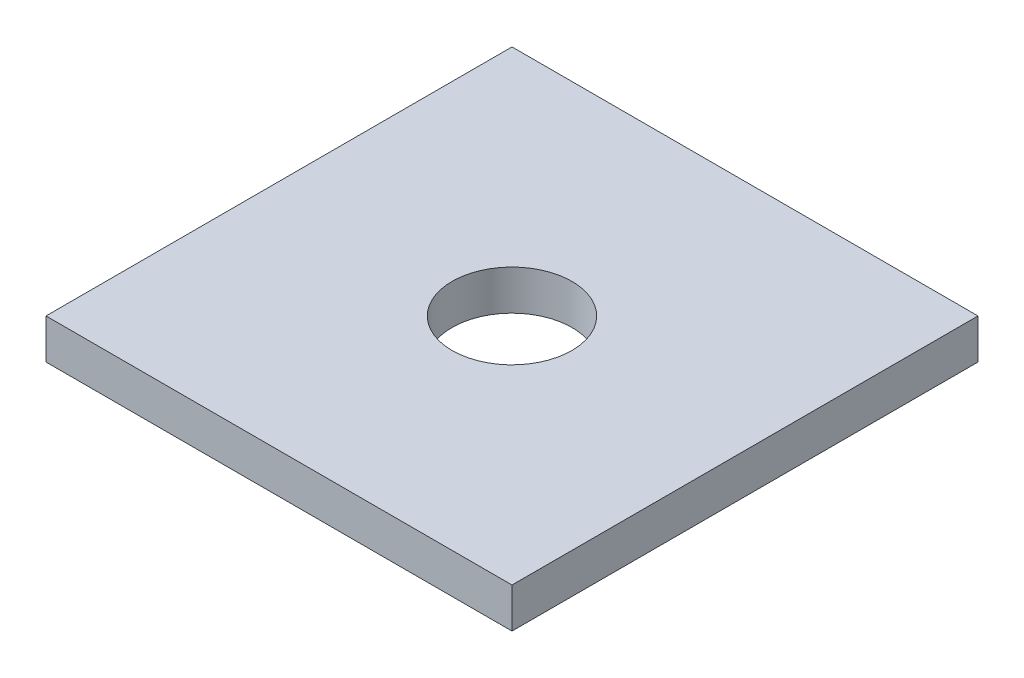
ISO-10303-21;
HEADER;
FILE_DESCRIPTION(('STEP AP214'),'2;1');
FILE_NAME('part.step','',(''),(''),'','','');
FILE_SCHEMA(('AUTOMOTIVE_DESIGN { 1 0 10303 214 1 1 1 1 }'));
ENDSEC;
DATA;
#1=APPLICATION_CONTEXT('core data for automotive mechanical design processes');
#2=APPLICATION_PROTOCOL_DEFINITION('international standard','automotive_design',2000,#1);
#3=PRODUCT_CONTEXT('',#1,'mechanical');
#4=PRODUCT('Part','Part','',(#3));
#5=PRODUCT_RELATED_PRODUCT_CATEGORY('part','',(#4));
#6=PRODUCT_DEFINITION_FORMATION('','',#4);
#7=PRODUCT_DEFINITION_CONTEXT('part definition',#1,'design');
#8=PRODUCT_DEFINITION('design','',#6,#7);
#9=PRODUCT_DEFINITION_SHAPE('','',#8);
#10=(LENGTH_UNIT() NAMED_UNIT(*) SI_UNIT(.MILLI.,.METRE.));
#11=(NAMED_UNIT(*) PLANE_ANGLE_UNIT() SI_UNIT($,.RADIAN.));
#12=(NAMED_UNIT(*) SI_UNIT($,.STERADIAN.) SOLID_ANGLE_UNIT());
#13=UNCERTAINTY_MEASURE_WITH_UNIT(LENGTH_MEASURE(1.E-05),#10,'distance_accuracy_value','');
#14=(GEOMETRIC_REPRESENTATION_CONTEXT(3) GLOBAL_UNCERTAINTY_ASSIGNED_CONTEXT((#13)) GLOBAL_UNIT_ASSIGNED_CONTEXT((#10,
#11,#12)) REPRESENTATION_CONTEXT('',''));
#15=CARTESIAN_POINT('',(0.,0.,0.));
#16=DIRECTION('',(0.,0.,1.));
#17=DIRECTION('',(1.,0.,0.));
#18=AXIS2_PLACEMENT_3D('',#15,#16,#17);
#19=CARTESIAN_POINT('',(0.,3.,-35.));
#20=DIRECTION('',(0.,-1.,0.));
#21=DIRECTION('',(0.,0.,-1.));
#22=AXIS2_PLACEMENT_3D('',#19,#20,#21);
#23=PLANE('',#22);
#24=DIRECTION('',(0.,0.,1.));
#25=VECTOR('',#24,1.);
#26=CARTESIAN_POINT('',(0.,3.,0.));
#27=LINE('',#26,#25);
#28=CARTESIAN_POINT('',(0.,3.,-35.));
#29=VERTEX_POINT('',#28);
#30=CARTESIAN_POINT('',(0.,3.,0.));
#31=VERTEX_POINT('',#30);
#32=EDGE_CURVE('E83',#29,#31,#27,.T.);
#33=ORIENTED_EDGE('',*,*,#32,.T.);
#34=DIRECTION('',(1.,0.,0.));
#35=VECTOR('',#34,1.);
#36=CARTESIAN_POINT('',(0.,3.,0.));
#37=LINE('',#36,#35);
#38=CARTESIAN_POINT('',(35.,3.,0.));
#39=VERTEX_POINT('',#38);
#40=EDGE_CURVE('E78',#31,#39,#37,.T.);
#41=ORIENTED_EDGE('',*,*,#40,.T.);
#42=DIRECTION('',(0.,0.,-1.));
#43=VECTOR('',#42,1.);
#44=CARTESIAN_POINT('',(35.,3.,0.));
#45=LINE('',#44,#43);
#46=CARTESIAN_POINT('',(35.,3.,-35.));
#47=VERTEX_POINT('',#46);
#48=EDGE_CURVE('E81',#39,#47,#45,.T.);
#49=ORIENTED_EDGE('',*,*,#48,.T.);
#50=DIRECTION('',(-1.,0.,0.));
#51=VECTOR('',#50,1.);
#52=CARTESIAN_POINT('',(0.,3.,-35.));
#53=LINE('',#52,#51);
#54=EDGE_CURVE('E48',#47,#29,#53,.T.);
#55=ORIENTED_EDGE('',*,*,#54,.T.);
#56=EDGE_LOOP('',(#33,#41,#49,#55));
#57=FACE_BOUND('',#56,.T.);
#58=CARTESIAN_POINT('',(17.5,3.,-17.5));
#59=DIRECTION('',(0.,1.,0.));
#60=DIRECTION('',(0.,0.,1.));
#61=AXIS2_PLACEMENT_3D('',#58,#59,#60);
#62=CIRCLE('',#61,4.5);
#63=CARTESIAN_POINT('',(17.5,3.,-13.));
#64=VERTEX_POINT('',#63);
#65=EDGE_CURVE('E98',#64,#64,#62,.T.);
#66=ORIENTED_EDGE('',*,*,#65,.F.);
#67=EDGE_LOOP('',(#66));
#68=FACE_BOUND('',#67,.T.);
#69=ADVANCED_FACE('F31',(#57,#68),#23,.F.);
#70=CARTESIAN_POINT('',(0.,0.,-35.));
#71=DIRECTION('',(0.,-1.,0.));
#72=DIRECTION('',(0.,0.,-1.));
#73=AXIS2_PLACEMENT_3D('',#70,#71,#72);
#74=PLANE('',#73);
#75=DIRECTION('',(0.,0.,1.));
#76=VECTOR('',#75,1.);
#77=CARTESIAN_POINT('',(0.,0.,0.));
#78=LINE('',#77,#76);
#79=CARTESIAN_POINT('',(0.,0.,-35.));
#80=VERTEX_POINT('',#79);
#81=CARTESIAN_POINT('',(0.,0.,0.));
#82=VERTEX_POINT('',#81);
#83=EDGE_CURVE('E95',#80,#82,#78,.T.);
#84=ORIENTED_EDGE('',*,*,#83,.F.);
#85=DIRECTION('',(-1.,0.,0.));
#86=VECTOR('',#85,1.);
#87=CARTESIAN_POINT('',(0.,0.,-35.));
#88=LINE('',#87,#86);
#89=CARTESIAN_POINT('',(35.,0.,-35.));
#90=VERTEX_POINT('',#89);
#91=EDGE_CURVE('E71',#90,#80,#88,.T.);
#92=ORIENTED_EDGE('',*,*,#91,.F.);
#93=DIRECTION('',(0.,0.,-1.));
#94=VECTOR('',#93,1.);
#95=CARTESIAN_POINT('',(35.,0.,0.));
#96=LINE('',#95,#94);
#97=CARTESIAN_POINT('',(35.,0.,0.));
#98=VERTEX_POINT('',#97);
#99=EDGE_CURVE('E65',#98,#90,#96,.T.);
#100=ORIENTED_EDGE('',*,*,#99,.F.);
#101=DIRECTION('',(1.,0.,0.));
#102=VECTOR('',#101,1.);
#103=CARTESIAN_POINT('',(0.,0.,0.));
#104=LINE('',#103,#102);
#105=EDGE_CURVE('E87',#82,#98,#104,.T.);
#106=ORIENTED_EDGE('',*,*,#105,.F.);
#107=EDGE_LOOP('',(#84,#92,#100,#106));
#108=FACE_BOUND('',#107,.T.);
#109=CARTESIAN_POINT('',(17.5,0.,-17.5));
#110=DIRECTION('',(0.,1.,0.));
#111=DIRECTION('',(0.,0.,1.));
#112=AXIS2_PLACEMENT_3D('',#109,#110,#111);
#113=CIRCLE('',#112,4.5);
#114=CARTESIAN_POINT('',(17.5,0.,-13.));
#115=VERTEX_POINT('',#114);
#116=EDGE_CURVE('E110',#115,#115,#113,.T.);
#117=ORIENTED_EDGE('',*,*,#116,.T.);
#118=EDGE_LOOP('',(#117));
#119=FACE_BOUND('',#118,.T.);
#120=ADVANCED_FACE('F106',(#108,#119),#74,.T.);
#121=CARTESIAN_POINT('',(0.,3.,0.));
#122=DIRECTION('',(1.,0.,0.));
#123=DIRECTION('',(0.,0.,-1.));
#124=AXIS2_PLACEMENT_3D('',#121,#122,#123);
#125=PLANE('',#124);
#126=ORIENTED_EDGE('',*,*,#83,.T.);
#127=DIRECTION('',(0.,-1.,0.));
#128=VECTOR('',#127,1.);
#129=CARTESIAN_POINT('',(0.,3.,0.));
#130=LINE('',#129,#128);
#131=EDGE_CURVE('E11',#31,#82,#130,.T.);
#132=ORIENTED_EDGE('',*,*,#131,.F.);
#133=ORIENTED_EDGE('',*,*,#32,.F.);
#134=DIRECTION('',(0.,-1.,0.));
#135=VECTOR('',#134,1.);
#136=CARTESIAN_POINT('',(0.,3.,-35.));
#137=LINE('',#136,#135);
#138=EDGE_CURVE('E91',#29,#80,#137,.T.);
#139=ORIENTED_EDGE('',*,*,#138,.T.);
#140=EDGE_LOOP('',(#126,#132,#133,#139));
#141=FACE_BOUND('',#140,.T.);
#142=ADVANCED_FACE('F33',(#141),#125,.F.);
#143=CARTESIAN_POINT('',(0.,3.,0.));
#144=DIRECTION('',(0.,0.,-1.));
#145=DIRECTION('',(-1.,0.,0.));
#146=AXIS2_PLACEMENT_3D('',#143,#144,#145);
#147=PLANE('',#146);
#148=ORIENTED_EDGE('',*,*,#105,.T.);
#149=DIRECTION('',(0.,-1.,0.));
#150=VECTOR('',#149,1.);
#151=CARTESIAN_POINT('',(35.,3.,0.));
#152=LINE('',#151,#150);
#153=EDGE_CURVE('E40',#39,#98,#152,.T.);
#154=ORIENTED_EDGE('',*,*,#153,.F.);
#155=ORIENTED_EDGE('',*,*,#40,.F.);
#156=ORIENTED_EDGE('',*,*,#131,.T.);
#157=EDGE_LOOP('',(#148,#154,#155,#156));
#158=FACE_BOUND('',#157,.T.);
#159=ADVANCED_FACE('F86',(#158),#147,.F.);
#160=CARTESIAN_POINT('',(35.,3.,0.));
#161=DIRECTION('',(-1.,0.,0.));
#162=DIRECTION('',(0.,0.,1.));
#163=AXIS2_PLACEMENT_3D('',#160,#161,#162);
#164=PLANE('',#163);
#165=ORIENTED_EDGE('',*,*,#99,.T.);
#166=DIRECTION('',(0.,-1.,0.));
#167=VECTOR('',#166,1.);
#168=CARTESIAN_POINT('',(35.,3.,-35.));
#169=LINE('',#168,#167);
#170=EDGE_CURVE('E88',#47,#90,#169,.T.);
#171=ORIENTED_EDGE('',*,*,#170,.F.);
#172=ORIENTED_EDGE('',*,*,#48,.F.);
#173=ORIENTED_EDGE('',*,*,#153,.T.);
#174=EDGE_LOOP('',(#165,#171,#172,#173));
#175=FACE_BOUND('',#174,.T.);
#176=ADVANCED_FACE('F89',(#175),#164,.F.);
#177=CARTESIAN_POINT('',(0.,3.,-35.));
#178=DIRECTION('',(0.,0.,1.));
#179=DIRECTION('',(1.,0.,0.));
#180=AXIS2_PLACEMENT_3D('',#177,#178,#179);
#181=PLANE('',#180);
#182=ORIENTED_EDGE('',*,*,#91,.T.);
#183=ORIENTED_EDGE('',*,*,#138,.F.);
#184=ORIENTED_EDGE('',*,*,#54,.F.);
#185=ORIENTED_EDGE('',*,*,#170,.T.);
#186=EDGE_LOOP('',(#182,#183,#184,#185));
#187=FACE_BOUND('',#186,.T.);
#188=ADVANCED_FACE('F103',(#187),#181,.F.);
#189=CARTESIAN_POINT('',(17.5,3.,-17.5));
#190=DIRECTION('',(0.,-1.,0.));
#191=DIRECTION('',(0.,0.,-1.));
#192=AXIS2_PLACEMENT_3D('',#189,#190,#191);
#193=CYLINDRICAL_SURFACE('',#192,4.5);
#194=ORIENTED_EDGE('',*,*,#65,.T.);
#195=EDGE_LOOP('',(#194));
#196=FACE_BOUND('',#195,.T.);
#197=ORIENTED_EDGE('',*,*,#116,.F.);
#198=EDGE_LOOP('',(#197));
#199=FACE_BOUND('',#198,.T.);
#200=ADVANCED_FACE('F116',(#196,#199),#193,.F.);
#201=CLOSED_SHELL('',(#69,#120,#142,#159,#176,#188,#200));
#202=MANIFOLD_SOLID_BREP('B2',#201);
#203=ADVANCED_BREP_SHAPE_REPRESENTATION('',(#18,#202),#14);
#204=SHAPE_DEFINITION_REPRESENTATION(#9,#203);
ENDSEC;
END-ISO-10303-21;
